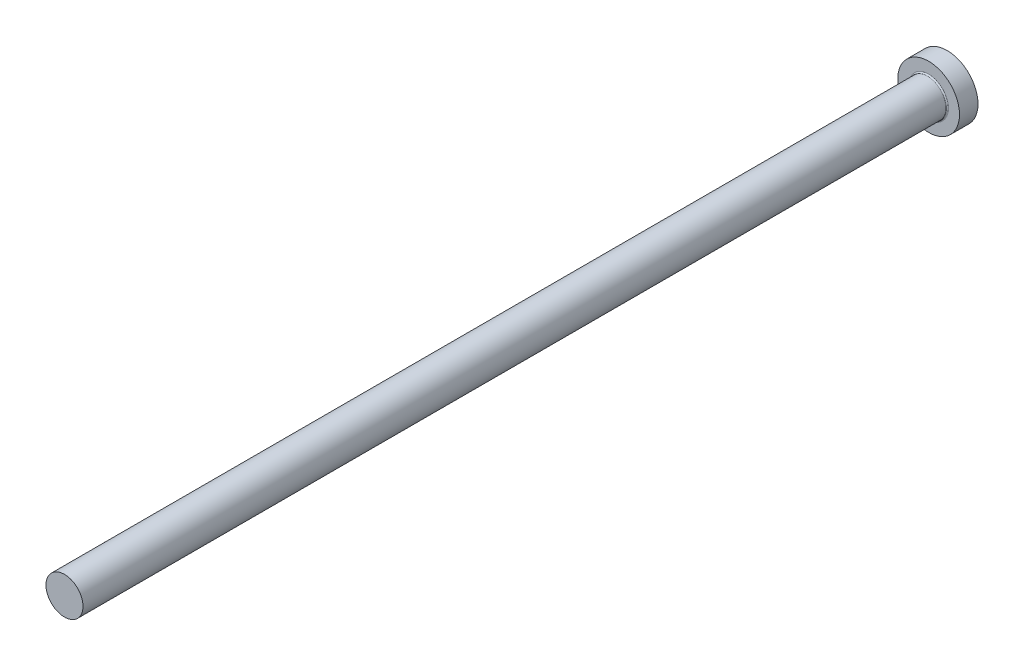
ISO-10303-21;
HEADER;
FILE_DESCRIPTION(('STEP AP214'),'2;1');
FILE_NAME('part.step','',(''),(''),'','','');
FILE_SCHEMA(('AUTOMOTIVE_DESIGN { 1 0 10303 214 1 1 1 1 }'));
ENDSEC;
DATA;
#1=APPLICATION_CONTEXT('core data for automotive mechanical design processes');
#2=APPLICATION_PROTOCOL_DEFINITION('international standard','automotive_design',2000,#1);
#3=PRODUCT_CONTEXT('',#1,'mechanical');
#4=PRODUCT('Part','Part','',(#3));
#5=PRODUCT_RELATED_PRODUCT_CATEGORY('part','',(#4));
#6=PRODUCT_DEFINITION_FORMATION('','',#4);
#7=PRODUCT_DEFINITION_CONTEXT('part definition',#1,'design');
#8=PRODUCT_DEFINITION('design','',#6,#7);
#9=PRODUCT_DEFINITION_SHAPE('','',#8);
#10=(LENGTH_UNIT() NAMED_UNIT(*) SI_UNIT(.MILLI.,.METRE.));
#11=(NAMED_UNIT(*) PLANE_ANGLE_UNIT() SI_UNIT($,.RADIAN.));
#12=(NAMED_UNIT(*) SI_UNIT($,.STERADIAN.) SOLID_ANGLE_UNIT());
#13=UNCERTAINTY_MEASURE_WITH_UNIT(LENGTH_MEASURE(1.E-05),#10,'distance_accuracy_value','');
#14=(GEOMETRIC_REPRESENTATION_CONTEXT(3) GLOBAL_UNCERTAINTY_ASSIGNED_CONTEXT((#13)) GLOBAL_UNIT_ASSIGNED_CONTEXT((#10,
#11,#12)) REPRESENTATION_CONTEXT('',''));
#15=CARTESIAN_POINT('',(0.,0.,0.));
#16=DIRECTION('',(0.,0.,1.));
#17=DIRECTION('',(1.,0.,0.));
#18=AXIS2_PLACEMENT_3D('',#15,#16,#17);
#19=CARTESIAN_POINT('',(-12.4055,-42.687,-140.));
#20=DIRECTION('',(0.,0.,1.));
#21=DIRECTION('',(1.,0.,0.));
#22=AXIS2_PLACEMENT_3D('',#19,#20,#21);
#23=PLANE('',#22);
#24=CARTESIAN_POINT('',(-12.4055,-42.687,-140.));
#25=DIRECTION('',(0.,0.,1.));
#26=DIRECTION('',(1.,0.,0.));
#27=AXIS2_PLACEMENT_3D('',#24,#25,#26);
#28=CIRCLE('',#27,3.2);
#29=CARTESIAN_POINT('',(-9.2055,-42.687,-140.));
#30=VERTEX_POINT('',#29);
#31=EDGE_CURVE('E10',#30,#30,#28,.F.);
#32=ORIENTED_EDGE('',*,*,#31,.T.);
#33=EDGE_LOOP('',(#32));
#34=FACE_BOUND('',#33,.T.);
#35=CARTESIAN_POINT('',(-12.4055,-42.687,-140.));
#36=DIRECTION('',(0.,0.,1.));
#37=DIRECTION('',(1.,0.,0.));
#38=AXIS2_PLACEMENT_3D('',#35,#36,#37);
#39=CIRCLE('',#38,5.);
#40=CARTESIAN_POINT('',(-7.4055,-42.687,-140.));
#41=VERTEX_POINT('',#40);
#42=EDGE_CURVE('E41',#41,#41,#39,.T.);
#43=ORIENTED_EDGE('',*,*,#42,.T.);
#44=EDGE_LOOP('',(#43));
#45=FACE_BOUND('',#44,.T.);
#46=ADVANCED_FACE('F30',(#34,#45),#23,.T.);
#47=CARTESIAN_POINT('',(-12.4055,-42.687,-140.));
#48=DIRECTION('',(0.,0.,-1.));
#49=DIRECTION('',(-1.,0.,0.));
#50=AXIS2_PLACEMENT_3D('',#47,#48,#49);
#51=CYLINDRICAL_SURFACE('',#50,5.);
#52=ORIENTED_EDGE('',*,*,#42,.F.);
#53=EDGE_LOOP('',(#52));
#54=FACE_BOUND('',#53,.T.);
#55=CARTESIAN_POINT('',(-12.4055,-42.687,-143.));
#56=DIRECTION('',(0.,0.,1.));
#57=DIRECTION('',(1.,0.,0.));
#58=AXIS2_PLACEMENT_3D('',#55,#56,#57);
#59=CIRCLE('',#58,5.);
#60=CARTESIAN_POINT('',(-7.4055,-42.687,-143.));
#61=VERTEX_POINT('',#60);
#62=EDGE_CURVE('E45',#61,#61,#59,.T.);
#63=ORIENTED_EDGE('',*,*,#62,.T.);
#64=EDGE_LOOP('',(#63));
#65=FACE_BOUND('',#64,.T.);
#66=ADVANCED_FACE('F64',(#54,#65),#51,.T.);
#67=CARTESIAN_POINT('',(198.,-100.,-143.));
#68=DIRECTION('',(0.,0.,-1.));
#69=DIRECTION('',(-1.,0.,0.));
#70=AXIS2_PLACEMENT_3D('',#67,#68,#69);
#71=PLANE('',#70);
#72=ORIENTED_EDGE('',*,*,#62,.F.);
#73=EDGE_LOOP('',(#72));
#74=FACE_BOUND('',#73,.T.);
#75=ADVANCED_FACE('F58',(#74),#71,.T.);
#76=CARTESIAN_POINT('',(-12.4055,-42.687,-148.485281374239));
#77=DIRECTION('',(0.,0.,1.));
#78=DIRECTION('',(1.,0.,0.));
#79=AXIS2_PLACEMENT_3D('',#76,#77,#78);
#80=CYLINDRICAL_SURFACE('',#79,3.);
#81=CARTESIAN_POINT('',(-12.4055,-42.687,-139.8));
#82=DIRECTION('',(0.,0.,1.));
#83=DIRECTION('',(1.,0.,0.));
#84=AXIS2_PLACEMENT_3D('',#81,#82,#83);
#85=CIRCLE('',#84,3.);
#86=CARTESIAN_POINT('',(-9.4055,-42.687,-139.8));
#87=VERTEX_POINT('',#86);
#88=EDGE_CURVE('E37',#87,#87,#85,.T.);
#89=ORIENTED_EDGE('',*,*,#88,.T.);
#90=EDGE_LOOP('',(#89));
#91=FACE_BOUND('',#90,.T.);
#92=CARTESIAN_POINT('',(-12.4055,-42.687,0.000399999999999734));
#93=DIRECTION('',(0.,0.,1.));
#94=DIRECTION('',(1.,0.,0.));
#95=AXIS2_PLACEMENT_3D('',#92,#93,#94);
#96=CIRCLE('',#95,3.);
#97=CARTESIAN_POINT('',(-9.4055,-42.687,0.000399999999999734));
#98=VERTEX_POINT('',#97);
#99=EDGE_CURVE('E49',#98,#98,#96,.T.);
#100=ORIENTED_EDGE('',*,*,#99,.F.);
#101=EDGE_LOOP('',(#100));
#102=FACE_BOUND('',#101,.T.);
#103=ADVANCED_FACE('F56',(#91,#102),#80,.T.);
#104=CARTESIAN_POINT('',(-12.4055,-42.687,0.000399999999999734));
#105=DIRECTION('',(0.,0.,-1.));
#106=DIRECTION('',(-1.,0.,0.));
#107=AXIS2_PLACEMENT_3D('',#104,#105,#106);
#108=PLANE('',#107);
#109=ORIENTED_EDGE('',*,*,#99,.T.);
#110=EDGE_LOOP('',(#109));
#111=FACE_BOUND('',#110,.T.);
#112=ADVANCED_FACE('F54',(#111),#108,.F.);
#113=CARTESIAN_POINT('',(-12.4055,-42.687,-139.8));
#114=DIRECTION('',(0.,0.,1.));
#115=DIRECTION('',(1.,0.,0.));
#116=AXIS2_PLACEMENT_3D('',#113,#114,#115);
#117=TOROIDAL_SURFACE('',#116,3.2,0.2);
#118=ORIENTED_EDGE('',*,*,#31,.F.);
#119=EDGE_LOOP('',(#118));
#120=FACE_BOUND('',#119,.T.);
#121=ORIENTED_EDGE('',*,*,#88,.F.);
#122=EDGE_LOOP('',(#121));
#123=FACE_BOUND('',#122,.T.);
#124=ADVANCED_FACE('F32',(#120,#123),#117,.F.);
#125=CLOSED_SHELL('',(#46,#66,#75,#103,#112,#124));
#126=MANIFOLD_SOLID_BREP('B2',#125);
#127=ADVANCED_BREP_SHAPE_REPRESENTATION('',(#18,#126),#14);
#128=SHAPE_DEFINITION_REPRESENTATION(#9,#127);
ENDSEC;
END-ISO-10303-21;
